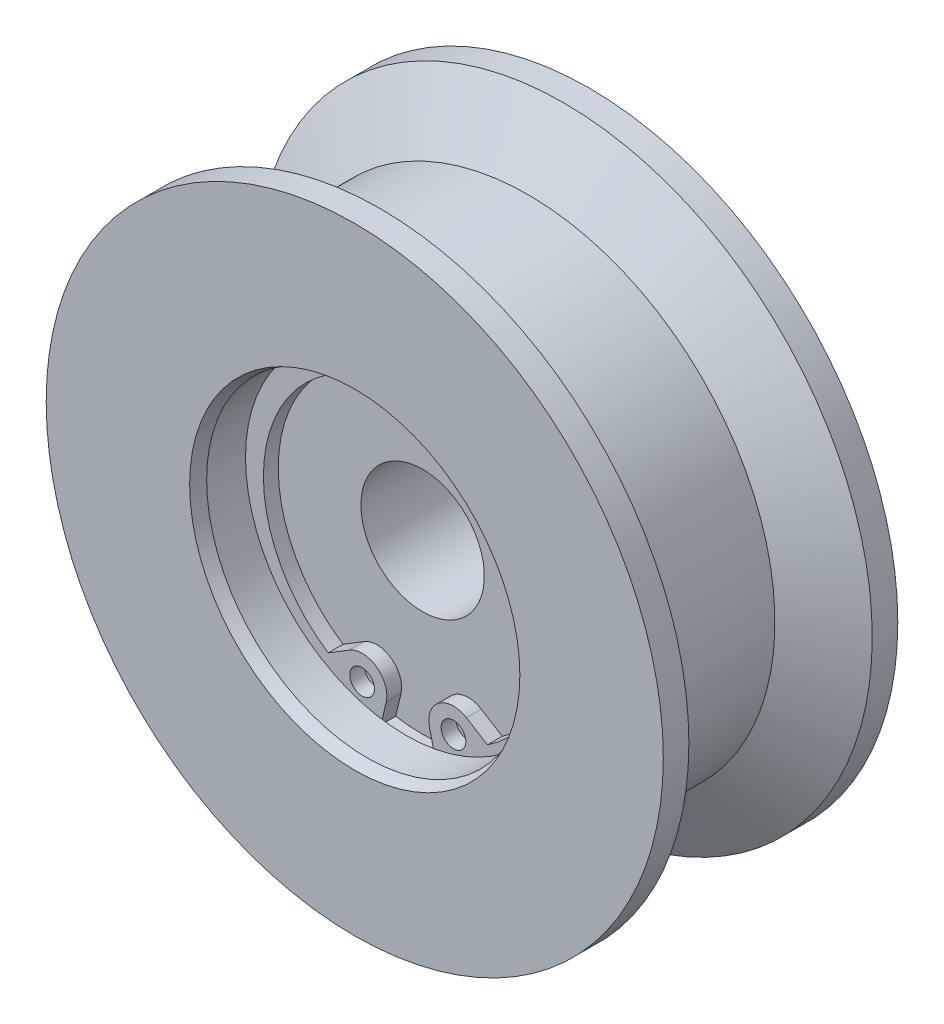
ISO-10303-21;
HEADER;
FILE_DESCRIPTION(('STEP AP214'),'2;1');
FILE_NAME('part.step','',(''),(''),'','','');
FILE_SCHEMA(('AUTOMOTIVE_DESIGN { 1 0 10303 214 1 1 1 1 }'));
ENDSEC;
DATA;
#1=APPLICATION_CONTEXT('core data for automotive mechanical design processes');
#2=APPLICATION_PROTOCOL_DEFINITION('international standard','automotive_design',2000,#1);
#3=PRODUCT_CONTEXT('',#1,'mechanical');
#4=PRODUCT('Part','Part','',(#3));
#5=PRODUCT_RELATED_PRODUCT_CATEGORY('part','',(#4));
#6=PRODUCT_DEFINITION_FORMATION('','',#4);
#7=PRODUCT_DEFINITION_CONTEXT('part definition',#1,'design');
#8=PRODUCT_DEFINITION('design','',#6,#7);
#9=PRODUCT_DEFINITION_SHAPE('','',#8);
#10=(LENGTH_UNIT() NAMED_UNIT(*) SI_UNIT(.MILLI.,.METRE.));
#11=(NAMED_UNIT(*) PLANE_ANGLE_UNIT() SI_UNIT($,.RADIAN.));
#12=(NAMED_UNIT(*) SI_UNIT($,.STERADIAN.) SOLID_ANGLE_UNIT());
#13=UNCERTAINTY_MEASURE_WITH_UNIT(LENGTH_MEASURE(1.E-05),#10,'distance_accuracy_value','');
#14=(GEOMETRIC_REPRESENTATION_CONTEXT(3) GLOBAL_UNCERTAINTY_ASSIGNED_CONTEXT((#13)) GLOBAL_UNIT_ASSIGNED_CONTEXT((#10,
#11,#12)) REPRESENTATION_CONTEXT('',''));
#15=CARTESIAN_POINT('',(0.,0.,0.));
#16=DIRECTION('',(0.,0.,1.));
#17=DIRECTION('',(1.,0.,0.));
#18=AXIS2_PLACEMENT_3D('',#15,#16,#17);
#19=CARTESIAN_POINT('',(0.,0.,-7.428229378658));
#20=DIRECTION('',(0.,0.,-1.));
#21=DIRECTION('',(1.,0.,0.));
#22=AXIS2_PLACEMENT_3D('',#19,#20,#21);
#23=CONICAL_SURFACE('',#22,25.,1.04719755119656);
#24=CARTESIAN_POINT('',(0.,0.,-4.54145188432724));
#25=DIRECTION('',(0.,0.,1.));
#26=DIRECTION('',(-1.,0.,0.));
#27=AXIS2_PLACEMENT_3D('',#24,#25,#26);
#28=CIRCLE('',#27,19.9999547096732);
#29=CARTESIAN_POINT('',(-19.9999547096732,0.,-4.54145188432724));
#30=VERTEX_POINT('',#29);
#31=EDGE_CURVE('E193',#30,#30,#28,.T.);
#32=ORIENTED_EDGE('',*,*,#31,.F.);
#33=EDGE_LOOP('',(#32));
#34=FACE_BOUND('',#33,.T.);
#35=CARTESIAN_POINT('',(0.,0.,-7.428229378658));
#36=DIRECTION('',(0.,0.,1.));
#37=DIRECTION('',(-1.,0.,0.));
#38=AXIS2_PLACEMENT_3D('',#35,#36,#37);
#39=CIRCLE('',#38,25.);
#40=CARTESIAN_POINT('',(-25.,0.,-7.428229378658));
#41=VERTEX_POINT('',#40);
#42=EDGE_CURVE('E196',#41,#41,#39,.T.);
#43=ORIENTED_EDGE('',*,*,#42,.T.);
#44=EDGE_LOOP('',(#43));
#45=FACE_BOUND('',#44,.T.);
#46=ADVANCED_FACE('F14',(#34,#45),#23,.T.);
#47=CARTESIAN_POINT('',(0.,0.,14.8688901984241));
#48=DIRECTION('',(0.,0.,1.));
#49=DIRECTION('',(-1.,0.,0.));
#50=AXIS2_PLACEMENT_3D('',#47,#48,#49);
#51=CYLINDRICAL_SURFACE('',#50,25.);
#52=ORIENTED_EDGE('',*,*,#42,.F.);
#53=EDGE_LOOP('',(#52));
#54=FACE_BOUND('',#53,.T.);
#55=CARTESIAN_POINT('',(0.,0.,-9.5));
#56=DIRECTION('',(0.,0.,1.));
#57=DIRECTION('',(-1.,0.,0.));
#58=AXIS2_PLACEMENT_3D('',#55,#56,#57);
#59=CIRCLE('',#58,25.);
#60=CARTESIAN_POINT('',(-25.,0.,-9.5));
#61=VERTEX_POINT('',#60);
#62=EDGE_CURVE('E199',#61,#61,#59,.T.);
#63=ORIENTED_EDGE('',*,*,#62,.T.);
#64=EDGE_LOOP('',(#63));
#65=FACE_BOUND('',#64,.T.);
#66=ADVANCED_FACE('F328',(#54,#65),#51,.T.);
#67=CARTESIAN_POINT('',(0.,0.,14.8688901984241));
#68=DIRECTION('',(0.,0.,1.));
#69=DIRECTION('',(-1.,0.,0.));
#70=AXIS2_PLACEMENT_3D('',#67,#68,#69);
#71=CYLINDRICAL_SURFACE('',#70,19.9999547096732);
#72=CARTESIAN_POINT('',(0.,0.,4.5414518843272));
#73=DIRECTION('',(0.,0.,1.));
#74=DIRECTION('',(-1.,0.,0.));
#75=AXIS2_PLACEMENT_3D('',#72,#73,#74);
#76=CIRCLE('',#75,19.9999547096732);
#77=CARTESIAN_POINT('',(-19.9999547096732,0.,4.5414518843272));
#78=VERTEX_POINT('',#77);
#79=EDGE_CURVE('E190',#78,#78,#76,.T.);
#80=ORIENTED_EDGE('',*,*,#79,.F.);
#81=EDGE_LOOP('',(#80));
#82=FACE_BOUND('',#81,.T.);
#83=ORIENTED_EDGE('',*,*,#31,.T.);
#84=EDGE_LOOP('',(#83));
#85=FACE_BOUND('',#84,.T.);
#86=ADVANCED_FACE('F326',(#82,#85),#71,.T.);
#87=CARTESIAN_POINT('',(0.,-11.,-9.5));
#88=DIRECTION('',(0.,0.,1.));
#89=DIRECTION('',(-1.,0.,0.));
#90=AXIS2_PLACEMENT_3D('',#87,#88,#89);
#91=PLANE('',#90);
#92=ORIENTED_EDGE('',*,*,#62,.F.);
#93=EDGE_LOOP('',(#92));
#94=FACE_BOUND('',#93,.T.);
#95=CARTESIAN_POINT('',(0.,0.,-9.5));
#96=DIRECTION('',(0.,0.,1.));
#97=DIRECTION('',(-1.,0.,0.));
#98=AXIS2_PLACEMENT_3D('',#95,#96,#97);
#99=CIRCLE('',#98,11.);
#100=CARTESIAN_POINT('',(-11.,0.,-9.5));
#101=VERTEX_POINT('',#100);
#102=EDGE_CURVE('E202',#101,#101,#99,.T.);
#103=ORIENTED_EDGE('',*,*,#102,.T.);
#104=EDGE_LOOP('',(#103));
#105=FACE_BOUND('',#104,.T.);
#106=ADVANCED_FACE('F323',(#94,#105),#91,.F.);
#107=CARTESIAN_POINT('',(0.,0.,4.5414518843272));
#108=DIRECTION('',(0.,0.,1.));
#109=DIRECTION('',(-1.,0.,0.));
#110=AXIS2_PLACEMENT_3D('',#107,#108,#109);
#111=CONICAL_SURFACE('',#110,19.9999547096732,1.04719755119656);
#112=CARTESIAN_POINT('',(0.,0.,7.428229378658));
#113=DIRECTION('',(0.,0.,1.));
#114=DIRECTION('',(-1.,0.,0.));
#115=AXIS2_PLACEMENT_3D('',#112,#113,#114);
#116=CIRCLE('',#115,25.);
#117=CARTESIAN_POINT('',(-25.,0.,7.428229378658));
#118=VERTEX_POINT('',#117);
#119=EDGE_CURVE('E187',#118,#118,#116,.T.);
#120=ORIENTED_EDGE('',*,*,#119,.F.);
#121=EDGE_LOOP('',(#120));
#122=FACE_BOUND('',#121,.T.);
#123=ORIENTED_EDGE('',*,*,#79,.T.);
#124=EDGE_LOOP('',(#123));
#125=FACE_BOUND('',#124,.T.);
#126=ADVANCED_FACE('F321',(#122,#125),#111,.T.);
#127=CARTESIAN_POINT('',(0.,0.,14.8688901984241));
#128=DIRECTION('',(0.,0.,1.));
#129=DIRECTION('',(-1.,0.,0.));
#130=AXIS2_PLACEMENT_3D('',#127,#128,#129);
#131=CYLINDRICAL_SURFACE('',#130,11.);
#132=ORIENTED_EDGE('',*,*,#102,.F.);
#133=EDGE_LOOP('',(#132));
#134=FACE_BOUND('',#133,.T.);
#135=CARTESIAN_POINT('',(0.,0.,-4.));
#136=DIRECTION('',(0.,0.,1.));
#137=DIRECTION('',(-1.,0.,0.));
#138=AXIS2_PLACEMENT_3D('',#135,#136,#137);
#139=CIRCLE('',#138,11.);
#140=CARTESIAN_POINT('',(-11.,0.,-4.));
#141=VERTEX_POINT('',#140);
#142=EDGE_CURVE('E205',#141,#141,#139,.T.);
#143=ORIENTED_EDGE('',*,*,#142,.T.);
#144=EDGE_LOOP('',(#143));
#145=FACE_BOUND('',#144,.T.);
#146=ADVANCED_FACE('F318',(#134,#145),#131,.F.);
#147=CARTESIAN_POINT('',(0.,0.,14.8688901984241));
#148=DIRECTION('',(0.,0.,1.));
#149=DIRECTION('',(-1.,0.,0.));
#150=AXIS2_PLACEMENT_3D('',#147,#148,#149);
#151=CYLINDRICAL_SURFACE('',#150,25.);
#152=CARTESIAN_POINT('',(0.,0.,9.5));
#153=DIRECTION('',(0.,0.,1.));
#154=DIRECTION('',(-1.,0.,0.));
#155=AXIS2_PLACEMENT_3D('',#152,#153,#154);
#156=CIRCLE('',#155,25.);
#157=CARTESIAN_POINT('',(-25.,0.,9.5));
#158=VERTEX_POINT('',#157);
#159=EDGE_CURVE('E184',#158,#158,#156,.T.);
#160=ORIENTED_EDGE('',*,*,#159,.F.);
#161=EDGE_LOOP('',(#160));
#162=FACE_BOUND('',#161,.T.);
#163=ORIENTED_EDGE('',*,*,#119,.T.);
#164=EDGE_LOOP('',(#163));
#165=FACE_BOUND('',#164,.T.);
#166=ADVANCED_FACE('F316',(#162,#165),#151,.T.);
#167=CARTESIAN_POINT('',(0.,-11.,-4.));
#168=DIRECTION('',(0.,0.,1.));
#169=DIRECTION('',(-1.,0.,0.));
#170=AXIS2_PLACEMENT_3D('',#167,#168,#169);
#171=PLANE('',#170);
#172=ORIENTED_EDGE('',*,*,#142,.F.);
#173=EDGE_LOOP('',(#172));
#174=FACE_BOUND('',#173,.T.);
#175=CARTESIAN_POINT('',(0.,0.,-4.));
#176=DIRECTION('',(0.,0.,1.));
#177=DIRECTION('',(-1.,0.,0.));
#178=AXIS2_PLACEMENT_3D('',#175,#176,#177);
#179=CIRCLE('',#178,5.);
#180=CARTESIAN_POINT('',(-5.,0.,-4.));
#181=VERTEX_POINT('',#180);
#182=EDGE_CURVE('E208',#181,#181,#179,.T.);
#183=ORIENTED_EDGE('',*,*,#182,.T.);
#184=EDGE_LOOP('',(#183));
#185=FACE_BOUND('',#184,.T.);
#186=ADVANCED_FACE('F313',(#174,#185),#171,.F.);
#187=CARTESIAN_POINT('',(0.,-13.3773502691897,9.5));
#188=DIRECTION('',(0.,0.,-1.));
#189=DIRECTION('',(1.,0.,0.));
#190=AXIS2_PLACEMENT_3D('',#187,#188,#189);
#191=PLANE('',#190);
#192=CARTESIAN_POINT('',(0.,0.,9.49999999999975));
#193=DIRECTION('',(0.,0.,1.));
#194=DIRECTION('',(-1.,0.,0.));
#195=AXIS2_PLACEMENT_3D('',#192,#193,#194);
#196=CIRCLE('',#195,13.3773502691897);
#197=CARTESIAN_POINT('',(-13.3773502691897,0.,9.49999999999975));
#198=VERTEX_POINT('',#197);
#199=EDGE_CURVE('E176',#198,#198,#196,.T.);
#200=ORIENTED_EDGE('',*,*,#199,.F.);
#201=EDGE_LOOP('',(#200));
#202=FACE_BOUND('',#201,.T.);
#203=ORIENTED_EDGE('',*,*,#159,.T.);
#204=EDGE_LOOP('',(#203));
#205=FACE_BOUND('',#204,.T.);
#206=ADVANCED_FACE('F311',(#202,#205),#191,.F.);
#207=CARTESIAN_POINT('',(0.,0.,14.8688901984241));
#208=DIRECTION('',(0.,0.,1.));
#209=DIRECTION('',(-1.,0.,0.));
#210=AXIS2_PLACEMENT_3D('',#207,#208,#209);
#211=CYLINDRICAL_SURFACE('',#210,5.);
#212=ORIENTED_EDGE('',*,*,#182,.F.);
#213=EDGE_LOOP('',(#212));
#214=FACE_BOUND('',#213,.T.);
#215=CARTESIAN_POINT('',(0.,0.,4.00000000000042));
#216=DIRECTION('',(0.,0.,1.));
#217=DIRECTION('',(-1.,0.,0.));
#218=AXIS2_PLACEMENT_3D('',#215,#216,#217);
#219=CIRCLE('',#218,5.);
#220=CARTESIAN_POINT('',(-5.,0.,4.00000000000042));
#221=VERTEX_POINT('',#220);
#222=EDGE_CURVE('E211',#221,#221,#219,.T.);
#223=ORIENTED_EDGE('',*,*,#222,.T.);
#224=EDGE_LOOP('',(#223));
#225=FACE_BOUND('',#224,.T.);
#226=ADVANCED_FACE('F307',(#214,#225),#211,.F.);
#227=CARTESIAN_POINT('',(0.,0.,9.49999999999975));
#228=DIRECTION('',(0.,0.,1.));
#229=DIRECTION('',(-1.,0.,0.));
#230=AXIS2_PLACEMENT_3D('',#227,#228,#229);
#231=CONICAL_SURFACE('',#230,13.3773502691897,0.360829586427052);
#232=CARTESIAN_POINT('',(0.,0.,8.49999999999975));
#233=DIRECTION('',(0.,0.,1.));
#234=DIRECTION('',(-1.,0.,0.));
#235=AXIS2_PLACEMENT_3D('',#232,#233,#234);
#236=CIRCLE('',#235,13.);
#237=CARTESIAN_POINT('',(-13.,0.,8.49999999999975));
#238=VERTEX_POINT('',#237);
#239=EDGE_CURVE('E172',#238,#238,#236,.T.);
#240=ORIENTED_EDGE('',*,*,#239,.F.);
#241=EDGE_LOOP('',(#240));
#242=FACE_BOUND('',#241,.T.);
#243=ORIENTED_EDGE('',*,*,#199,.T.);
#244=EDGE_LOOP('',(#243));
#245=FACE_BOUND('',#244,.T.);
#246=ADVANCED_FACE('F310',(#242,#245),#231,.F.);
#247=CARTESIAN_POINT('',(0.,0.,14.8688901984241));
#248=DIRECTION('',(0.,0.,1.));
#249=DIRECTION('',(-1.,0.,0.));
#250=AXIS2_PLACEMENT_3D('',#247,#248,#249);
#251=CYLINDRICAL_SURFACE('',#250,13.);
#252=CARTESIAN_POINT('',(0.,0.,5.35000000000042));
#253=DIRECTION('',(0.,0.,1.));
#254=DIRECTION('',(1.,0.,0.));
#255=AXIS2_PLACEMENT_3D('',#252,#253,#254);
#256=CIRCLE('',#255,13.);
#257=CARTESIAN_POINT('',(13.,0.,5.35000000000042));
#258=VERTEX_POINT('',#257);
#259=EDGE_CURVE('E18',#258,#258,#256,.F.);
#260=ORIENTED_EDGE('',*,*,#259,.T.);
#261=EDGE_LOOP('',(#260));
#262=FACE_BOUND('',#261,.T.);
#263=ORIENTED_EDGE('',*,*,#239,.T.);
#264=EDGE_LOOP('',(#263));
#265=FACE_BOUND('',#264,.T.);
#266=ADVANCED_FACE('F305',(#262,#265),#251,.F.);
#267=CARTESIAN_POINT('',(0.,-11.3718951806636,4.00000000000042));
#268=DIRECTION('',(0.,0.,-1.));
#269=DIRECTION('',(1.,0.,0.));
#270=AXIS2_PLACEMENT_3D('',#267,#268,#269);
#271=PLANE('',#270);
#272=ORIENTED_EDGE('',*,*,#222,.F.);
#273=EDGE_LOOP('',(#272));
#274=FACE_BOUND('',#273,.T.);
#275=DIRECTION('',(0.231349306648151,-0.972870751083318,0.));
#276=VECTOR('',#275,1.);
#277=CARTESIAN_POINT('',(1.60272371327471,-10.9907664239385,4.00000000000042));
#278=LINE('',#277,#276);
#279=CARTESIAN_POINT('',(1.75425849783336,-11.6280009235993,4.00000000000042));
#280=VERTEX_POINT('',#279);
#281=CARTESIAN_POINT('',(2.1813307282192,-13.4239262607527,4.00000000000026));
#282=VERTEX_POINT('',#281);
#283=EDGE_CURVE('E9',#280,#282,#278,.T.);
#284=ORIENTED_EDGE('',*,*,#283,.F.);
#285=CARTESIAN_POINT('',(3.7,-11.165302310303,4.00000000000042));
#286=DIRECTION('',(0.,0.,-1.));
#287=DIRECTION('',(-1.,0.,0.));
#288=AXIS2_PLACEMENT_3D('',#285,#286,#287);
#289=CIRCLE('',#288,2.);
#290=CARTESIAN_POINT('',(4.74866968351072,-9.46227797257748,4.00000000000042));
#291=VERTEX_POINT('',#290);
#292=EDGE_CURVE('E25',#280,#291,#289,.T.);
#293=ORIENTED_EDGE('',*,*,#292,.T.);
#294=DIRECTION('',(-0.851512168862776,0.524334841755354,0.));
#295=VECTOR('',#294,1.);
#296=CARTESIAN_POINT('',(2.15813874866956,-7.86710919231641,4.00000000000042));
#297=LINE('',#296,#295);
#298=CARTESIAN_POINT('',(6.45127454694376,-10.5106893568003,4.00000000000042));
#299=VERTEX_POINT('',#298);
#300=EDGE_CURVE('E102',#299,#291,#297,.T.);
#301=ORIENTED_EDGE('',*,*,#300,.F.);
#302=CARTESIAN_POINT('',(0.,-0.75,4.00000000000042));
#303=DIRECTION('',(0.,0.,-1.));
#304=DIRECTION('',(-1.,0.,0.));
#305=AXIS2_PLACEMENT_3D('',#302,#303,#304);
#306=CIRCLE('',#305,11.7);
#307=CARTESIAN_POINT('',(-6.45127454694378,-10.5106893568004,4.00000000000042));
#308=VERTEX_POINT('',#307);
#309=EDGE_CURVE('E105',#308,#299,#306,.T.);
#310=ORIENTED_EDGE('',*,*,#309,.F.);
#311=DIRECTION('',(-0.851512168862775,-0.524334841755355,0.));
#312=VECTOR('',#311,1.);
#313=CARTESIAN_POINT('',(-2.15813874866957,-7.86710919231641,4.00000000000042));
#314=LINE('',#313,#312);
#315=CARTESIAN_POINT('',(-4.74866968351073,-9.46227797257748,4.00000000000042));
#316=VERTEX_POINT('',#315);
#317=EDGE_CURVE('E120',#316,#308,#314,.T.);
#318=ORIENTED_EDGE('',*,*,#317,.F.);
#319=CARTESIAN_POINT('',(-3.7,-11.165302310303,4.00000000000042));
#320=DIRECTION('',(0.,0.,-1.));
#321=DIRECTION('',(-1.,0.,0.));
#322=AXIS2_PLACEMENT_3D('',#319,#320,#321);
#323=CIRCLE('',#322,2.);
#324=CARTESIAN_POINT('',(-1.75425849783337,-11.6280009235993,4.00000000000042));
#325=VERTEX_POINT('',#324);
#326=EDGE_CURVE('E231',#316,#325,#323,.T.);
#327=ORIENTED_EDGE('',*,*,#326,.T.);
#328=DIRECTION('',(0.231349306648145,0.97287075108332,0.));
#329=VECTOR('',#328,1.);
#330=CARTESIAN_POINT('',(-1.60272371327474,-10.9907664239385,4.00000000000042));
#331=LINE('',#330,#329);
#332=CARTESIAN_POINT('',(-2.18133072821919,-13.4239262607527,4.00000000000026));
#333=VERTEX_POINT('',#332);
#334=EDGE_CURVE('E234',#333,#325,#331,.T.);
#335=ORIENTED_EDGE('',*,*,#334,.F.);
#336=CARTESIAN_POINT('',(0.,0.,4.00000000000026));
#337=DIRECTION('',(0.,0.,1.));
#338=DIRECTION('',(1.,0.,0.));
#339=AXIS2_PLACEMENT_3D('',#336,#337,#338);
#340=CIRCLE('',#339,13.6);
#341=EDGE_CURVE('E167',#333,#282,#340,.T.);
#342=ORIENTED_EDGE('',*,*,#341,.T.);
#343=EDGE_LOOP('',(#284,#293,#301,#310,#318,#327,#335,#342));
#344=FACE_BOUND('',#343,.T.);
#345=ADVANCED_FACE('F104',(#274,#344),#271,.F.);
#346=CARTESIAN_POINT('',(0.,0.,4.00000000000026));
#347=DIRECTION('',(0.,0.,1.));
#348=DIRECTION('',(1.,0.,0.));
#349=AXIS2_PLACEMENT_3D('',#346,#347,#348);
#350=CYLINDRICAL_SURFACE('',#349,13.6);
#351=DIRECTION('',(0.,0.,1.));
#352=VECTOR('',#351,1.);
#353=CARTESIAN_POINT('',(2.1813307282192,-13.4239262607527,4.00000000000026));
#354=LINE('',#353,#352);
#355=CARTESIAN_POINT('',(2.1813307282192,-13.4239262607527,5.20000000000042));
#356=VERTEX_POINT('',#355);
#357=EDGE_CURVE('E217',#282,#356,#354,.T.);
#358=ORIENTED_EDGE('',*,*,#357,.F.);
#359=ORIENTED_EDGE('',*,*,#341,.F.);
#360=DIRECTION('',(0.,0.,1.));
#361=VECTOR('',#360,1.);
#362=CARTESIAN_POINT('',(-2.18133072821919,-13.4239262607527,4.00000000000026));
#363=LINE('',#362,#361);
#364=CARTESIAN_POINT('',(-2.18133072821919,-13.4239262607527,5.20000000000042));
#365=VERTEX_POINT('',#364);
#366=EDGE_CURVE('E214',#365,#333,#363,.F.);
#367=ORIENTED_EDGE('',*,*,#366,.F.);
#368=CARTESIAN_POINT('',(0.,0.,5.20000000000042));
#369=DIRECTION('',(0.,0.,1.));
#370=DIRECTION('',(1.,0.,0.));
#371=AXIS2_PLACEMENT_3D('',#368,#369,#370);
#372=CIRCLE('',#371,13.6);
#373=EDGE_CURVE('E179',#356,#365,#372,.T.);
#374=ORIENTED_EDGE('',*,*,#373,.F.);
#375=EDGE_LOOP('',(#358,#359,#367,#374));
#376=FACE_BOUND('',#375,.T.);
#377=CARTESIAN_POINT('',(0.,0.,5.35000000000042));
#378=DIRECTION('',(0.,0.,1.));
#379=DIRECTION('',(1.,0.,0.));
#380=AXIS2_PLACEMENT_3D('',#377,#378,#379);
#381=CIRCLE('',#380,13.6);
#382=CARTESIAN_POINT('',(13.6,0.,5.35000000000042));
#383=VERTEX_POINT('',#382);
#384=EDGE_CURVE('E362',#383,#383,#381,.T.);
#385=ORIENTED_EDGE('',*,*,#384,.T.);
#386=EDGE_LOOP('',(#385));
#387=FACE_BOUND('',#386,.T.);
#388=ADVANCED_FACE('F254',(#376,#387),#350,.F.);
#389=CARTESIAN_POINT('',(3.7,-11.165302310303,4.00000000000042));
#390=DIRECTION('',(0.,0.,-1.));
#391=DIRECTION('',(-1.,0.,0.));
#392=AXIS2_PLACEMENT_3D('',#389,#390,#391);
#393=CIRCLE('',#392,1.);
#394=CARTESIAN_POINT('',(2.7,-11.165302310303,4.00000000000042));
#395=VERTEX_POINT('',#394);
#396=EDGE_CURVE('E223',#395,#395,#393,.T.);
#397=ORIENTED_EDGE('',*,*,#396,.F.);
#398=EDGE_LOOP('',(#397));
#399=FACE_BOUND('',#398,.T.);
#400=ADVANCED_FACE('F282',(#399),#271,.F.);
#401=CARTESIAN_POINT('',(-3.7,-11.165302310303,4.00000000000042));
#402=DIRECTION('',(0.,0.,-1.));
#403=DIRECTION('',(-1.,0.,0.));
#404=AXIS2_PLACEMENT_3D('',#401,#402,#403);
#405=CIRCLE('',#404,1.);
#406=CARTESIAN_POINT('',(-4.7,-11.165302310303,4.00000000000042));
#407=VERTEX_POINT('',#406);
#408=EDGE_CURVE('E227',#407,#407,#405,.T.);
#409=ORIENTED_EDGE('',*,*,#408,.F.);
#410=EDGE_LOOP('',(#409));
#411=FACE_BOUND('',#410,.T.);
#412=ADVANCED_FACE('F276',(#411),#271,.F.);
#413=CARTESIAN_POINT('',(4.74866968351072,-9.46227797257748,5.20000000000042));
#414=DIRECTION('',(-0.524334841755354,-0.851512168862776,0.));
#415=DIRECTION('',(-0.851512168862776,0.524334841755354,0.));
#416=AXIS2_PLACEMENT_3D('',#413,#414,#415);
#417=PLANE('',#416);
#418=ORIENTED_EDGE('',*,*,#300,.T.);
#419=DIRECTION('',(0.,0.,-1.));
#420=VECTOR('',#419,1.);
#421=CARTESIAN_POINT('',(4.74866968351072,-9.46227797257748,5.20000000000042));
#422=LINE('',#421,#420);
#423=CARTESIAN_POINT('',(4.74866968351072,-9.46227797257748,5.20000000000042));
#424=VERTEX_POINT('',#423);
#425=EDGE_CURVE('E152',#424,#291,#422,.T.);
#426=ORIENTED_EDGE('',*,*,#425,.F.);
#427=DIRECTION('',(-0.851512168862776,0.524334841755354,0.));
#428=VECTOR('',#427,1.);
#429=CARTESIAN_POINT('',(4.74866968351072,-9.46227797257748,5.20000000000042));
#430=LINE('',#429,#428);
#431=CARTESIAN_POINT('',(6.45127454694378,-10.5106893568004,5.20000000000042));
#432=VERTEX_POINT('',#431);
#433=EDGE_CURVE('E124',#432,#424,#430,.T.);
#434=ORIENTED_EDGE('',*,*,#433,.F.);
#435=DIRECTION('',(0.,0.,-1.));
#436=VECTOR('',#435,1.);
#437=CARTESIAN_POINT('',(6.45127454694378,-10.5106893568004,5.20000000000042));
#438=LINE('',#437,#436);
#439=EDGE_CURVE('E115',#432,#299,#438,.T.);
#440=ORIENTED_EDGE('',*,*,#439,.T.);
#441=EDGE_LOOP('',(#418,#426,#434,#440));
#442=FACE_BOUND('',#441,.T.);
#443=ADVANCED_FACE('F122',(#442),#417,.F.);
#444=CARTESIAN_POINT('',(0.,-0.75,5.20000000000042));
#445=DIRECTION('',(0.,0.,1.));
#446=DIRECTION('',(-1.,0.,0.));
#447=AXIS2_PLACEMENT_3D('',#444,#445,#446);
#448=CYLINDRICAL_SURFACE('',#447,11.7);
#449=ORIENTED_EDGE('',*,*,#309,.T.);
#450=ORIENTED_EDGE('',*,*,#439,.F.);
#451=CARTESIAN_POINT('',(0.,-0.75,5.20000000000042));
#452=DIRECTION('',(0.,0.,-1.));
#453=DIRECTION('',(0.,-1.,0.));
#454=AXIS2_PLACEMENT_3D('',#451,#452,#453);
#455=CIRCLE('',#454,11.7);
#456=CARTESIAN_POINT('',(-6.45127454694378,-10.5106893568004,5.20000000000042));
#457=VERTEX_POINT('',#456);
#458=EDGE_CURVE('E133',#457,#432,#455,.T.);
#459=ORIENTED_EDGE('',*,*,#458,.F.);
#460=DIRECTION('',(0.,0.,-1.));
#461=VECTOR('',#460,1.);
#462=CARTESIAN_POINT('',(-6.45127454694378,-10.5106893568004,5.20000000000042));
#463=LINE('',#462,#461);
#464=EDGE_CURVE('E118',#457,#308,#463,.T.);
#465=ORIENTED_EDGE('',*,*,#464,.T.);
#466=EDGE_LOOP('',(#449,#450,#459,#465));
#467=FACE_BOUND('',#466,.T.);
#468=ADVANCED_FACE('F16',(#467),#448,.F.);
#469=CARTESIAN_POINT('',(-4.74866968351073,-9.46227797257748,5.20000000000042));
#470=DIRECTION('',(0.524334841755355,-0.851512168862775,0.));
#471=DIRECTION('',(0.,0.,-1.));
#472=AXIS2_PLACEMENT_3D('',#469,#470,#471);
#473=PLANE('',#472);
#474=ORIENTED_EDGE('',*,*,#317,.T.);
#475=ORIENTED_EDGE('',*,*,#464,.F.);
#476=DIRECTION('',(-0.851512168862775,-0.524334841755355,0.));
#477=VECTOR('',#476,1.);
#478=CARTESIAN_POINT('',(-4.74866968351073,-9.46227797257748,5.20000000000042));
#479=LINE('',#478,#477);
#480=CARTESIAN_POINT('',(-4.74866968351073,-9.46227797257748,5.20000000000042));
#481=VERTEX_POINT('',#480);
#482=EDGE_CURVE('E126',#481,#457,#479,.T.);
#483=ORIENTED_EDGE('',*,*,#482,.F.);
#484=DIRECTION('',(0.,0.,-1.));
#485=VECTOR('',#484,1.);
#486=CARTESIAN_POINT('',(-4.74866968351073,-9.46227797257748,5.20000000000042));
#487=LINE('',#486,#485);
#488=EDGE_CURVE('E131',#481,#316,#487,.T.);
#489=ORIENTED_EDGE('',*,*,#488,.T.);
#490=EDGE_LOOP('',(#474,#475,#483,#489));
#491=FACE_BOUND('',#490,.T.);
#492=ADVANCED_FACE('F244',(#491),#473,.F.);
#493=CARTESIAN_POINT('',(3.7,-11.165302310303,5.20000000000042));
#494=DIRECTION('',(0.,0.,1.));
#495=DIRECTION('',(-1.,0.,0.));
#496=AXIS2_PLACEMENT_3D('',#493,#494,#495);
#497=CYLINDRICAL_SURFACE('',#496,1.);
#498=ORIENTED_EDGE('',*,*,#396,.T.);
#499=EDGE_LOOP('',(#498));
#500=FACE_BOUND('',#499,.T.);
#501=CARTESIAN_POINT('',(3.7,-11.165302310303,5.20000000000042));
#502=DIRECTION('',(0.,0.,1.));
#503=DIRECTION('',(1.,0.,0.));
#504=AXIS2_PLACEMENT_3D('',#501,#502,#503);
#505=CIRCLE('',#504,1.);
#506=CARTESIAN_POINT('',(4.7,-11.165302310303,5.20000000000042));
#507=VERTEX_POINT('',#506);
#508=EDGE_CURVE('E151',#507,#507,#505,.T.);
#509=ORIENTED_EDGE('',*,*,#508,.T.);
#510=EDGE_LOOP('',(#509));
#511=FACE_BOUND('',#510,.T.);
#512=ADVANCED_FACE('F288',(#500,#511),#497,.F.);
#513=CARTESIAN_POINT('',(-3.7,-11.165302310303,5.20000000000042));
#514=DIRECTION('',(0.,0.,1.));
#515=DIRECTION('',(-1.,0.,0.));
#516=AXIS2_PLACEMENT_3D('',#513,#514,#515);
#517=CYLINDRICAL_SURFACE('',#516,1.);
#518=ORIENTED_EDGE('',*,*,#408,.T.);
#519=EDGE_LOOP('',(#518));
#520=FACE_BOUND('',#519,.T.);
#521=CARTESIAN_POINT('',(-3.7,-11.165302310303,5.20000000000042));
#522=DIRECTION('',(0.,0.,-1.));
#523=DIRECTION('',(1.,0.,0.));
#524=AXIS2_PLACEMENT_3D('',#521,#522,#523);
#525=CIRCLE('',#524,1.);
#526=CARTESIAN_POINT('',(-2.7,-11.165302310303,5.20000000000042));
#527=VERTEX_POINT('',#526);
#528=EDGE_CURVE('E143',#527,#527,#525,.T.);
#529=ORIENTED_EDGE('',*,*,#528,.F.);
#530=EDGE_LOOP('',(#529));
#531=FACE_BOUND('',#530,.T.);
#532=ADVANCED_FACE('F271',(#520,#531),#517,.F.);
#533=CARTESIAN_POINT('',(3.7,-11.165302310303,5.20000000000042));
#534=DIRECTION('',(0.,0.,1.));
#535=DIRECTION('',(-1.,0.,0.));
#536=AXIS2_PLACEMENT_3D('',#533,#534,#535);
#537=CYLINDRICAL_SURFACE('',#536,2.);
#538=ORIENTED_EDGE('',*,*,#292,.F.);
#539=DIRECTION('',(0.,0.,-1.));
#540=VECTOR('',#539,1.);
#541=CARTESIAN_POINT('',(1.75425849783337,-11.6280009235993,5.20000000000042));
#542=LINE('',#541,#540);
#543=CARTESIAN_POINT('',(1.75425849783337,-11.6280009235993,5.20000000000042));
#544=VERTEX_POINT('',#543);
#545=EDGE_CURVE('E150',#544,#280,#542,.T.);
#546=ORIENTED_EDGE('',*,*,#545,.F.);
#547=CARTESIAN_POINT('',(3.7,-11.165302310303,5.20000000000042));
#548=DIRECTION('',(0.,0.,1.));
#549=DIRECTION('',(1.,0.,0.));
#550=AXIS2_PLACEMENT_3D('',#547,#548,#549);
#551=CIRCLE('',#550,2.);
#552=EDGE_CURVE('E137',#424,#544,#551,.T.);
#553=ORIENTED_EDGE('',*,*,#552,.F.);
#554=ORIENTED_EDGE('',*,*,#425,.T.);
#555=EDGE_LOOP('',(#538,#546,#553,#554));
#556=FACE_BOUND('',#555,.T.);
#557=ADVANCED_FACE('F261',(#556),#537,.T.);
#558=CARTESIAN_POINT('',(0.,-0.75,5.20000000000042));
#559=DIRECTION('',(0.,0.,-1.));
#560=DIRECTION('',(0.,-1.,0.));
#561=AXIS2_PLACEMENT_3D('',#558,#559,#560);
#562=PLANE('',#561);
#563=ORIENTED_EDGE('',*,*,#528,.T.);
#564=EDGE_LOOP('',(#563));
#565=FACE_BOUND('',#564,.T.);
#566=ORIENTED_EDGE('',*,*,#508,.F.);
#567=EDGE_LOOP('',(#566));
#568=FACE_BOUND('',#567,.T.);
#569=ORIENTED_EDGE('',*,*,#552,.T.);
#570=DIRECTION('',(-0.231349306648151,0.972870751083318,0.));
#571=VECTOR('',#570,1.);
#572=CARTESIAN_POINT('',(-0.956782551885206,-0.227523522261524,5.20000000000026));
#573=LINE('',#572,#571);
#574=EDGE_CURVE('E78',#356,#544,#573,.T.);
#575=ORIENTED_EDGE('',*,*,#574,.F.);
#576=ORIENTED_EDGE('',*,*,#373,.T.);
#577=DIRECTION('',(-0.231349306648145,-0.97287075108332,0.));
#578=VECTOR('',#577,1.);
#579=CARTESIAN_POINT('',(0.956782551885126,-0.227523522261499,5.20000000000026));
#580=LINE('',#579,#578);
#581=CARTESIAN_POINT('',(-1.75425849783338,-11.6280009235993,5.20000000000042));
#582=VERTEX_POINT('',#581);
#583=EDGE_CURVE('E71',#582,#365,#580,.T.);
#584=ORIENTED_EDGE('',*,*,#583,.F.);
#585=CARTESIAN_POINT('',(-3.7,-11.165302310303,5.20000000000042));
#586=DIRECTION('',(0.,0.,1.));
#587=DIRECTION('',(-1.,0.,0.));
#588=AXIS2_PLACEMENT_3D('',#585,#586,#587);
#589=CIRCLE('',#588,2.);
#590=EDGE_CURVE('E140',#582,#481,#589,.T.);
#591=ORIENTED_EDGE('',*,*,#590,.T.);
#592=ORIENTED_EDGE('',*,*,#482,.T.);
#593=ORIENTED_EDGE('',*,*,#458,.T.);
#594=ORIENTED_EDGE('',*,*,#433,.T.);
#595=EDGE_LOOP('',(#569,#575,#576,#584,#591,#592,#593,#594));
#596=FACE_BOUND('',#595,.T.);
#597=ADVANCED_FACE('F262',(#565,#568,#596),#562,.F.);
#598=CARTESIAN_POINT('',(-3.7,-11.165302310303,5.20000000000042));
#599=DIRECTION('',(0.,0.,1.));
#600=DIRECTION('',(-1.,0.,0.));
#601=AXIS2_PLACEMENT_3D('',#598,#599,#600);
#602=CYLINDRICAL_SURFACE('',#601,2.);
#603=ORIENTED_EDGE('',*,*,#326,.F.);
#604=ORIENTED_EDGE('',*,*,#488,.F.);
#605=ORIENTED_EDGE('',*,*,#590,.F.);
#606=DIRECTION('',(0.,0.,-1.));
#607=VECTOR('',#606,1.);
#608=CARTESIAN_POINT('',(-1.75425849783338,-11.6280009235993,5.20000000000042));
#609=LINE('',#608,#607);
#610=EDGE_CURVE('E146',#582,#325,#609,.T.);
#611=ORIENTED_EDGE('',*,*,#610,.T.);
#612=EDGE_LOOP('',(#603,#604,#605,#611));
#613=FACE_BOUND('',#612,.T.);
#614=ADVANCED_FACE('F247',(#613),#602,.T.);
#615=CARTESIAN_POINT('',(-1.75425849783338,-11.6280009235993,5.20000000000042));
#616=DIRECTION('',(-0.97287075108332,0.231349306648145,0.));
#617=DIRECTION('',(0.,0.,1.));
#618=AXIS2_PLACEMENT_3D('',#615,#616,#617);
#619=PLANE('',#618);
#620=ORIENTED_EDGE('',*,*,#583,.T.);
#621=ORIENTED_EDGE('',*,*,#366,.T.);
#622=ORIENTED_EDGE('',*,*,#334,.T.);
#623=ORIENTED_EDGE('',*,*,#610,.F.);
#624=EDGE_LOOP('',(#620,#621,#622,#623));
#625=FACE_BOUND('',#624,.T.);
#626=ADVANCED_FACE('F250',(#625),#619,.F.);
#627=CARTESIAN_POINT('',(1.75425849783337,-11.6280009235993,5.20000000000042));
#628=DIRECTION('',(0.972870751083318,0.231349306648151,0.));
#629=DIRECTION('',(0.,0.,-1.));
#630=AXIS2_PLACEMENT_3D('',#627,#628,#629);
#631=PLANE('',#630);
#632=ORIENTED_EDGE('',*,*,#283,.T.);
#633=ORIENTED_EDGE('',*,*,#357,.T.);
#634=ORIENTED_EDGE('',*,*,#574,.T.);
#635=ORIENTED_EDGE('',*,*,#545,.T.);
#636=EDGE_LOOP('',(#632,#633,#634,#635));
#637=FACE_BOUND('',#636,.T.);
#638=ADVANCED_FACE('F257',(#637),#631,.F.);
#639=CARTESIAN_POINT('',(0.,0.,5.35000000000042));
#640=DIRECTION('',(0.,0.,1.));
#641=DIRECTION('',(1.,0.,0.));
#642=AXIS2_PLACEMENT_3D('',#639,#640,#641);
#643=PLANE('',#642);
#644=ORIENTED_EDGE('',*,*,#384,.F.);
#645=EDGE_LOOP('',(#644));
#646=FACE_BOUND('',#645,.T.);
#647=ORIENTED_EDGE('',*,*,#259,.F.);
#648=EDGE_LOOP('',(#647));
#649=FACE_BOUND('',#648,.T.);
#650=ADVANCED_FACE('F285',(#646,#649),#643,.F.);
#651=CLOSED_SHELL('',(#46,#66,#86,#106,#126,#146,#166,#186,#206,#226,#246,#266,#345,#388,#400,
#412,#443,#468,#492,#512,#532,#557,#597,#614,#626,#638,#650));
#652=MANIFOLD_SOLID_BREP('B1',#651);
#653=ADVANCED_BREP_SHAPE_REPRESENTATION('',(#18,#652),#14);
#654=SHAPE_DEFINITION_REPRESENTATION(#9,#653);
ENDSEC;
END-ISO-10303-21;
